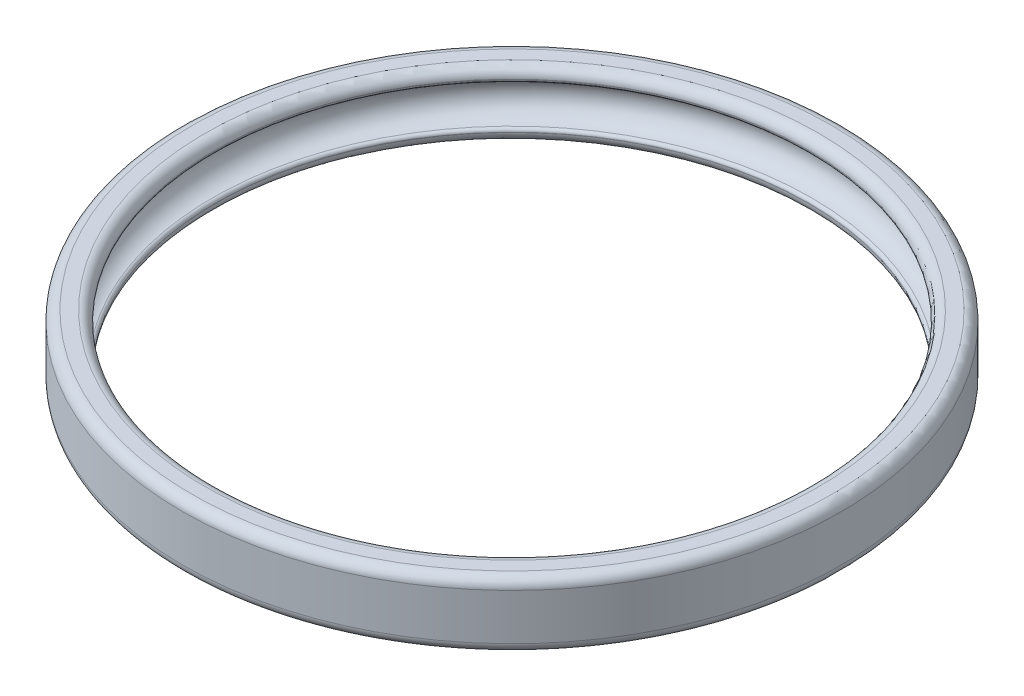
from build123d import *


with BuildPart() as part:
    # Sketch 1 → Revolve 1 (revolve)
    with BuildSketch(Plane.XY, mode=Mode.PRIVATE) as revolve_1_sk:
        with BuildLine():
            Line((45, 8.464101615), (45, 8.5))
            ThreePointArc((45, 8.5), (45.439339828, 9.560660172), (46.5, 10))
            Line((46.5, 10), (48.5, 10))
            ThreePointArc((48.5, 10), (49.560660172, 9.560660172), (50, 8.5))
            Line((50, 8.5), (50, 1.5))
            ThreePointArc((50, 1.5), (49.560660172, 0.439339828), (48.5, 0))
            Line((48.5, 0), (46.5, 0))
            ThreePointArc((46.5, 0), (45.439339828, 0.439339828), (45, 1.5))
            Line((45, 1.5), (45, 1.535898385))
            ThreePointArc((45, 1.535898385), (45.122035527, 1.86322522), (45.428571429, 2.030770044))
            ThreePointArc((45.428571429, 2.030770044), (48, 5), (45.428571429, 7.969229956))
            ThreePointArc((45.428571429, 7.969229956), (45.122035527, 8.13677478), (45, 8.464101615))
        make_face()
    revolve(revolve_1_sk.sketch.rotate(Axis((0, 0, 0), (0, 1, 0)), 90), axis=Axis((0, 0, 0), (0, 1, 0)))


solid = part.part
